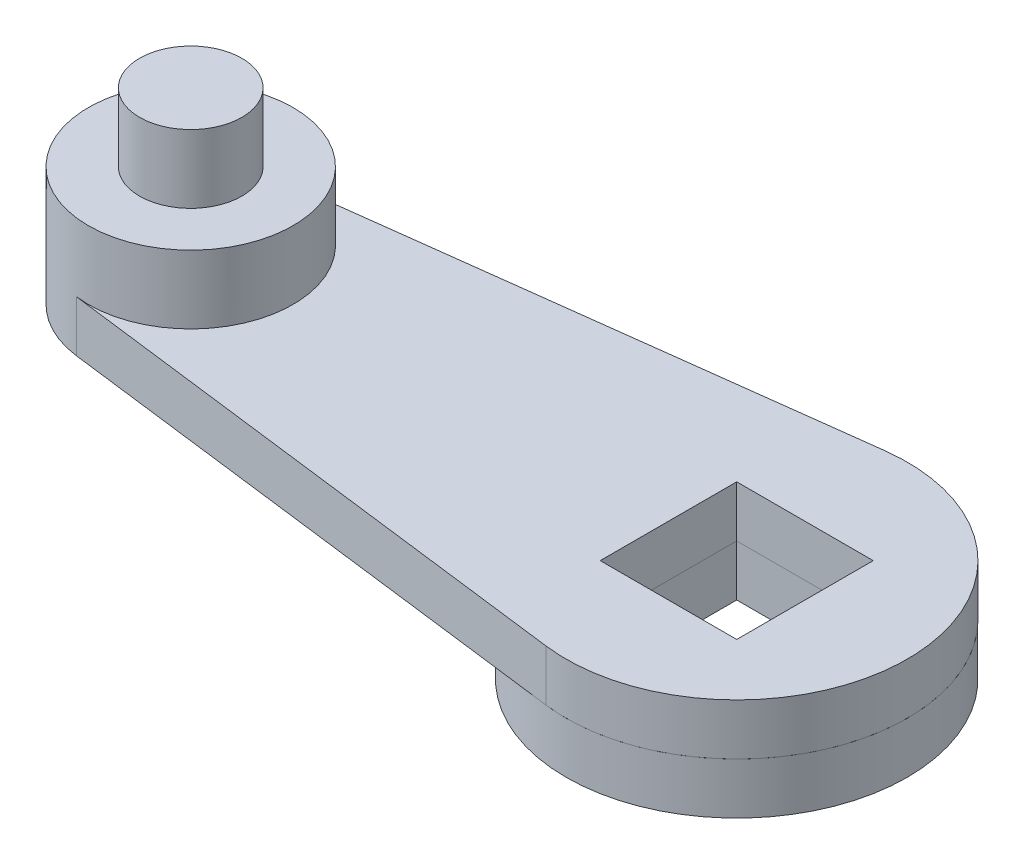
ISO-10303-21;
HEADER;
FILE_DESCRIPTION(('STEP AP214'),'2;1');
FILE_NAME('part.step','',(''),(''),'','','');
FILE_SCHEMA(('AUTOMOTIVE_DESIGN { 1 0 10303 214 1 1 1 1 }'));
ENDSEC;
DATA;
#1=APPLICATION_CONTEXT('core data for automotive mechanical design processes');
#2=APPLICATION_PROTOCOL_DEFINITION('international standard','automotive_design',2000,#1);
#3=PRODUCT_CONTEXT('',#1,'mechanical');
#4=PRODUCT('Part','Part','',(#3));
#5=PRODUCT_RELATED_PRODUCT_CATEGORY('part','',(#4));
#6=PRODUCT_DEFINITION_FORMATION('','',#4);
#7=PRODUCT_DEFINITION_CONTEXT('part definition',#1,'design');
#8=PRODUCT_DEFINITION('design','',#6,#7);
#9=PRODUCT_DEFINITION_SHAPE('','',#8);
#10=(LENGTH_UNIT() NAMED_UNIT(*) SI_UNIT(.MILLI.,.METRE.));
#11=(NAMED_UNIT(*) PLANE_ANGLE_UNIT() SI_UNIT($,.RADIAN.));
#12=(NAMED_UNIT(*) SI_UNIT($,.STERADIAN.) SOLID_ANGLE_UNIT());
#13=UNCERTAINTY_MEASURE_WITH_UNIT(LENGTH_MEASURE(1.E-05),#10,'distance_accuracy_value','');
#14=(GEOMETRIC_REPRESENTATION_CONTEXT(3) GLOBAL_UNCERTAINTY_ASSIGNED_CONTEXT((#13)) GLOBAL_UNIT_ASSIGNED_CONTEXT((#10,
#11,#12)) REPRESENTATION_CONTEXT('',''));
#15=CARTESIAN_POINT('',(0.,0.,0.));
#16=DIRECTION('',(0.,0.,1.));
#17=DIRECTION('',(1.,0.,0.));
#18=AXIS2_PLACEMENT_3D('',#15,#16,#17);
#19=CARTESIAN_POINT('',(-112.37396077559,-15.,-20.));
#20=DIRECTION('',(0.,0.,1.));
#21=DIRECTION('',(1.,0.,0.));
#22=AXIS2_PLACEMENT_3D('',#19,#20,#21);
#23=PLANE('',#22);
#24=DIRECTION('',(1.,0.,0.));
#25=VECTOR('',#24,1.);
#26=CARTESIAN_POINT('',(-112.37396077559,0.,-20.));
#27=LINE('',#26,#25);
#28=CARTESIAN_POINT('',(140.,0.,-20.));
#29=VERTEX_POINT('',#28);
#30=CARTESIAN_POINT('',(180.,0.,-20.));
#31=VERTEX_POINT('',#30);
#32=EDGE_CURVE('E83',#29,#31,#27,.T.);
#33=ORIENTED_EDGE('',*,*,#32,.F.);
#34=DIRECTION('',(0.,1.,0.));
#35=VECTOR('',#34,1.);
#36=CARTESIAN_POINT('',(140.,-15.,-20.));
#37=LINE('',#36,#35);
#38=CARTESIAN_POINT('',(140.,-15.,-20.));
#39=VERTEX_POINT('',#38);
#40=EDGE_CURVE('E12',#39,#29,#37,.T.);
#41=ORIENTED_EDGE('',*,*,#40,.F.);
#42=DIRECTION('',(1.,0.,0.));
#43=VECTOR('',#42,1.);
#44=CARTESIAN_POINT('',(-112.37396077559,-15.,-20.));
#45=LINE('',#44,#43);
#46=CARTESIAN_POINT('',(180.,-15.,-20.));
#47=VERTEX_POINT('',#46);
#48=EDGE_CURVE('E84',#39,#47,#45,.T.);
#49=ORIENTED_EDGE('',*,*,#48,.T.);
#50=DIRECTION('',(0.,1.,0.));
#51=VECTOR('',#50,1.);
#52=CARTESIAN_POINT('',(180.,-15.,-20.));
#53=LINE('',#52,#51);
#54=EDGE_CURVE('E46',#47,#31,#53,.T.);
#55=ORIENTED_EDGE('',*,*,#54,.T.);
#56=EDGE_LOOP('',(#33,#41,#49,#55));
#57=FACE_BOUND('',#56,.T.);
#58=ADVANCED_FACE('F43',(#57),#23,.T.);
#59=CARTESIAN_POINT('',(140.,-15.,0.));
#60=DIRECTION('',(-1.,0.,0.));
#61=DIRECTION('',(0.,0.,1.));
#62=AXIS2_PLACEMENT_3D('',#59,#60,#61);
#63=PLANE('',#62);
#64=DIRECTION('',(0.,0.,1.));
#65=VECTOR('',#64,1.);
#66=CARTESIAN_POINT('',(140.,0.,0.));
#67=LINE('',#66,#65);
#68=CARTESIAN_POINT('',(140.,0.,20.));
#69=VERTEX_POINT('',#68);
#70=EDGE_CURVE('E102',#29,#69,#67,.T.);
#71=ORIENTED_EDGE('',*,*,#70,.T.);
#72=DIRECTION('',(0.,1.,0.));
#73=VECTOR('',#72,1.);
#74=CARTESIAN_POINT('',(140.,-15.,20.));
#75=LINE('',#74,#73);
#76=CARTESIAN_POINT('',(140.,-15.,20.));
#77=VERTEX_POINT('',#76);
#78=EDGE_CURVE('E51',#77,#69,#75,.T.);
#79=ORIENTED_EDGE('',*,*,#78,.F.);
#80=DIRECTION('',(0.,0.,1.));
#81=VECTOR('',#80,1.);
#82=CARTESIAN_POINT('',(140.,-15.,0.));
#83=LINE('',#82,#81);
#84=EDGE_CURVE('E64',#39,#77,#83,.T.);
#85=ORIENTED_EDGE('',*,*,#84,.F.);
#86=ORIENTED_EDGE('',*,*,#40,.T.);
#87=EDGE_LOOP('',(#71,#79,#85,#86));
#88=FACE_BOUND('',#87,.T.);
#89=ADVANCED_FACE('F123',(#88),#63,.F.);
#90=CARTESIAN_POINT('',(-112.37396077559,-15.,20.));
#91=DIRECTION('',(0.,0.,1.));
#92=DIRECTION('',(1.,0.,0.));
#93=AXIS2_PLACEMENT_3D('',#90,#91,#92);
#94=PLANE('',#93);
#95=DIRECTION('',(1.,0.,0.));
#96=VECTOR('',#95,1.);
#97=CARTESIAN_POINT('',(-112.37396077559,0.,20.));
#98=LINE('',#97,#96);
#99=CARTESIAN_POINT('',(180.,0.,20.));
#100=VERTEX_POINT('',#99);
#101=EDGE_CURVE('E97',#69,#100,#98,.T.);
#102=ORIENTED_EDGE('',*,*,#101,.T.);
#103=DIRECTION('',(0.,1.,0.));
#104=VECTOR('',#103,1.);
#105=CARTESIAN_POINT('',(180.,-15.,20.));
#106=LINE('',#105,#104);
#107=CARTESIAN_POINT('',(180.,-15.,20.));
#108=VERTEX_POINT('',#107);
#109=EDGE_CURVE('E88',#108,#100,#106,.T.);
#110=ORIENTED_EDGE('',*,*,#109,.F.);
#111=DIRECTION('',(1.,0.,0.));
#112=VECTOR('',#111,1.);
#113=CARTESIAN_POINT('',(-112.37396077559,-15.,20.));
#114=LINE('',#113,#112);
#115=EDGE_CURVE('E113',#77,#108,#114,.T.);
#116=ORIENTED_EDGE('',*,*,#115,.F.);
#117=ORIENTED_EDGE('',*,*,#78,.T.);
#118=EDGE_LOOP('',(#102,#110,#116,#117));
#119=FACE_BOUND('',#118,.T.);
#120=ADVANCED_FACE('F121',(#119),#94,.F.);
#121=CARTESIAN_POINT('',(180.,-15.,0.));
#122=DIRECTION('',(-1.,0.,0.));
#123=DIRECTION('',(0.,0.,1.));
#124=AXIS2_PLACEMENT_3D('',#121,#122,#123);
#125=PLANE('',#124);
#126=DIRECTION('',(0.,0.,1.));
#127=VECTOR('',#126,1.);
#128=CARTESIAN_POINT('',(180.,0.,0.));
#129=LINE('',#128,#127);
#130=EDGE_CURVE('E91',#31,#100,#129,.T.);
#131=ORIENTED_EDGE('',*,*,#130,.F.);
#132=ORIENTED_EDGE('',*,*,#54,.F.);
#133=DIRECTION('',(0.,0.,1.));
#134=VECTOR('',#133,1.);
#135=CARTESIAN_POINT('',(180.,-15.,0.));
#136=LINE('',#135,#134);
#137=EDGE_CURVE('E111',#47,#108,#136,.T.);
#138=ORIENTED_EDGE('',*,*,#137,.T.);
#139=ORIENTED_EDGE('',*,*,#109,.T.);
#140=EDGE_LOOP('',(#131,#132,#138,#139));
#141=FACE_BOUND('',#140,.T.);
#142=ADVANCED_FACE('F92',(#141),#125,.T.);
#143=CARTESIAN_POINT('',(160.,-15.,0.));
#144=DIRECTION('',(0.,1.,0.));
#145=DIRECTION('',(0.,0.,1.));
#146=AXIS2_PLACEMENT_3D('',#143,#144,#145);
#147=CYLINDRICAL_SURFACE('',#146,50.);
#148=CARTESIAN_POINT('',(160.,-15.,0.));
#149=DIRECTION('',(0.,1.,0.));
#150=DIRECTION('',(0.,0.,1.));
#151=AXIS2_PLACEMENT_3D('',#148,#149,#150);
#152=CIRCLE('',#151,50.);
#153=CARTESIAN_POINT('',(160.,-15.,50.));
#154=VERTEX_POINT('',#153);
#155=EDGE_CURVE('E89',#154,#154,#152,.T.);
#156=ORIENTED_EDGE('',*,*,#155,.T.);
#157=EDGE_LOOP('',(#156));
#158=FACE_BOUND('',#157,.T.);
#159=CARTESIAN_POINT('',(160.,0.,0.));
#160=DIRECTION('',(0.,1.,0.));
#161=DIRECTION('',(0.,0.,1.));
#162=AXIS2_PLACEMENT_3D('',#159,#160,#161);
#163=CIRCLE('',#162,50.);
#164=CARTESIAN_POINT('',(160.,0.,50.));
#165=VERTEX_POINT('',#164);
#166=EDGE_CURVE('E107',#165,#165,#163,.T.);
#167=ORIENTED_EDGE('',*,*,#166,.F.);
#168=EDGE_LOOP('',(#167));
#169=FACE_BOUND('',#168,.T.);
#170=ADVANCED_FACE('F127',(#158,#169),#147,.T.);
#171=CARTESIAN_POINT('',(-112.37396077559,-15.,0.));
#172=DIRECTION('',(0.,1.,0.));
#173=DIRECTION('',(0.,0.,1.));
#174=AXIS2_PLACEMENT_3D('',#171,#172,#173);
#175=PLANE('',#174);
#176=ORIENTED_EDGE('',*,*,#48,.F.);
#177=ORIENTED_EDGE('',*,*,#84,.T.);
#178=ORIENTED_EDGE('',*,*,#115,.T.);
#179=ORIENTED_EDGE('',*,*,#137,.F.);
#180=EDGE_LOOP('',(#176,#177,#178,#179));
#181=FACE_BOUND('',#180,.T.);
#182=ORIENTED_EDGE('',*,*,#155,.F.);
#183=EDGE_LOOP('',(#182));
#184=FACE_BOUND('',#183,.T.);
#185=ADVANCED_FACE('F124',(#181,#184),#175,.F.);
#186=CARTESIAN_POINT('',(-112.37396077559,0.,0.));
#187=DIRECTION('',(0.,1.,0.));
#188=DIRECTION('',(0.,0.,1.));
#189=AXIS2_PLACEMENT_3D('',#186,#187,#188);
#190=PLANE('',#189);
#191=ORIENTED_EDGE('',*,*,#32,.T.);
#192=ORIENTED_EDGE('',*,*,#130,.T.);
#193=ORIENTED_EDGE('',*,*,#101,.F.);
#194=ORIENTED_EDGE('',*,*,#70,.F.);
#195=EDGE_LOOP('',(#191,#192,#193,#194));
#196=FACE_BOUND('',#195,.T.);
#197=ORIENTED_EDGE('',*,*,#166,.T.);
#198=EDGE_LOOP('',(#197));
#199=FACE_BOUND('',#198,.T.);
#200=ADVANCED_FACE('F100',(#196,#199),#190,.T.);
#201=CLOSED_SHELL('',(#58,#89,#120,#142,#170,#185,#200));
#202=MANIFOLD_SOLID_BREP('B2',#201);
#203=CARTESIAN_POINT('',(-112.37396077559,35.,0.));
#204=DIRECTION('',(0.,1.,0.));
#205=DIRECTION('',(0.,0.,1.));
#206=AXIS2_PLACEMENT_3D('',#203,#204,#205);
#207=PLANE('',#206);
#208=CARTESIAN_POINT('',(0.,35.,0.));
#209=DIRECTION('',(0.,1.,0.));
#210=DIRECTION('',(0.,0.,1.));
#211=AXIS2_PLACEMENT_3D('',#208,#209,#210);
#212=CIRCLE('',#211,30.);
#213=CARTESIAN_POINT('',(0.,35.,30.));
#214=VERTEX_POINT('',#213);
#215=EDGE_CURVE('E41',#214,#214,#212,.T.);
#216=ORIENTED_EDGE('',*,*,#215,.T.);
#217=EDGE_LOOP('',(#216));
#218=FACE_BOUND('',#217,.T.);
#219=CARTESIAN_POINT('',(0.,35.,0.));
#220=DIRECTION('',(0.,1.,0.));
#221=DIRECTION('',(0.,0.,1.));
#222=AXIS2_PLACEMENT_3D('',#219,#220,#221);
#223=CIRCLE('',#222,15.);
#224=CARTESIAN_POINT('',(0.,35.,15.));
#225=VERTEX_POINT('',#224);
#226=EDGE_CURVE('E278',#225,#225,#223,.T.);
#227=ORIENTED_EDGE('',*,*,#226,.F.);
#228=EDGE_LOOP('',(#227));
#229=FACE_BOUND('',#228,.T.);
#230=ADVANCED_FACE('F188',(#218,#229),#207,.T.);
#231=CARTESIAN_POINT('',(0.,35.,0.));
#232=DIRECTION('',(0.,-1.,0.));
#233=DIRECTION('',(0.,0.,-1.));
#234=AXIS2_PLACEMENT_3D('',#231,#232,#233);
#235=CYLINDRICAL_SURFACE('',#234,30.);
#236=ORIENTED_EDGE('',*,*,#215,.F.);
#237=EDGE_LOOP('',(#236));
#238=FACE_BOUND('',#237,.T.);
#239=DIRECTION('',(0.,-1.,0.));
#240=VECTOR('',#239,1.);
#241=CARTESIAN_POINT('',(-3.75,15.,29.7647022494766));
#242=LINE('',#241,#240);
#243=CARTESIAN_POINT('',(-3.75,15.,29.7647022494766));
#244=VERTEX_POINT('',#243);
#245=CARTESIAN_POINT('',(-3.75,0.,29.7647022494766));
#246=VERTEX_POINT('',#245);
#247=EDGE_CURVE('E208',#244,#246,#242,.T.);
#248=ORIENTED_EDGE('',*,*,#247,.F.);
#249=CARTESIAN_POINT('',(0.,15.,0.));
#250=DIRECTION('',(0.,1.,0.));
#251=DIRECTION('',(0.,0.,1.));
#252=AXIS2_PLACEMENT_3D('',#249,#250,#251);
#253=CIRCLE('',#252,30.);
#254=CARTESIAN_POINT('',(-3.75,15.,-29.7647022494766));
#255=VERTEX_POINT('',#254);
#256=EDGE_CURVE('E203',#244,#255,#253,.T.);
#257=ORIENTED_EDGE('',*,*,#256,.T.);
#258=DIRECTION('',(0.,-1.,0.));
#259=VECTOR('',#258,1.);
#260=CARTESIAN_POINT('',(-3.75,15.,-29.7647022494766));
#261=LINE('',#260,#259);
#262=CARTESIAN_POINT('',(-3.75,0.,-29.7647022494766));
#263=VERTEX_POINT('',#262);
#264=EDGE_CURVE('E322',#255,#263,#261,.T.);
#265=ORIENTED_EDGE('',*,*,#264,.T.);
#266=CARTESIAN_POINT('',(0.,0.,0.));
#267=DIRECTION('',(0.,1.,0.));
#268=DIRECTION('',(0.,0.,1.));
#269=AXIS2_PLACEMENT_3D('',#266,#267,#268);
#270=CIRCLE('',#269,30.);
#271=EDGE_CURVE('E196',#263,#246,#270,.T.);
#272=ORIENTED_EDGE('',*,*,#271,.T.);
#273=EDGE_LOOP('',(#248,#257,#265,#272));
#274=FACE_BOUND('',#273,.T.);
#275=ADVANCED_FACE('F190',(#238,#274),#235,.T.);
#276=CARTESIAN_POINT('',(-112.37396077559,0.,0.));
#277=DIRECTION('',(0.,1.,0.));
#278=DIRECTION('',(0.,0.,1.));
#279=AXIS2_PLACEMENT_3D('',#276,#277,#278);
#280=PLANE('',#279);
#281=ORIENTED_EDGE('',*,*,#271,.F.);
#282=DIRECTION('',(0.992156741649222,0.,-0.125));
#283=VECTOR('',#282,1.);
#284=CARTESIAN_POINT('',(-114.368117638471,0.,-15.8281294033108));
#285=LINE('',#284,#283);
#286=CARTESIAN_POINT('',(153.75,0.,-49.6078370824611));
#287=VERTEX_POINT('',#286);
#288=EDGE_CURVE('E261',#263,#287,#285,.T.);
#289=ORIENTED_EDGE('',*,*,#288,.T.);
#290=CARTESIAN_POINT('',(160.,0.,0.));
#291=DIRECTION('',(0.,1.,0.));
#292=DIRECTION('',(0.,0.,1.));
#293=AXIS2_PLACEMENT_3D('',#290,#291,#292);
#294=CIRCLE('',#293,50.);
#295=CARTESIAN_POINT('',(153.75,0.,49.6078370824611));
#296=VERTEX_POINT('',#295);
#297=EDGE_CURVE('E254',#296,#287,#294,.T.);
#298=ORIENTED_EDGE('',*,*,#297,.F.);
#299=DIRECTION('',(0.992156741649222,0.,0.125));
#300=VECTOR('',#299,1.);
#301=CARTESIAN_POINT('',(-114.368117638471,0.,15.8281294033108));
#302=LINE('',#301,#300);
#303=EDGE_CURVE('E259',#246,#296,#302,.T.);
#304=ORIENTED_EDGE('',*,*,#303,.F.);
#305=EDGE_LOOP('',(#281,#289,#298,#304));
#306=FACE_BOUND('',#305,.T.);
#307=DIRECTION('',(1.,0.,0.));
#308=VECTOR('',#307,1.);
#309=CARTESIAN_POINT('',(-112.37396077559,0.,-20.));
#310=LINE('',#309,#308);
#311=CARTESIAN_POINT('',(140.,0.,-20.));
#312=VERTEX_POINT('',#311);
#313=CARTESIAN_POINT('',(180.,0.,-20.));
#314=VERTEX_POINT('',#313);
#315=EDGE_CURVE('E283',#312,#314,#310,.T.);
#316=ORIENTED_EDGE('',*,*,#315,.F.);
#317=DIRECTION('',(0.,0.,1.));
#318=VECTOR('',#317,1.);
#319=CARTESIAN_POINT('',(140.,0.,0.));
#320=LINE('',#319,#318);
#321=CARTESIAN_POINT('',(140.,0.,20.));
#322=VERTEX_POINT('',#321);
#323=EDGE_CURVE('E292',#312,#322,#320,.T.);
#324=ORIENTED_EDGE('',*,*,#323,.T.);
#325=DIRECTION('',(1.,0.,0.));
#326=VECTOR('',#325,1.);
#327=CARTESIAN_POINT('',(-112.37396077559,0.,20.));
#328=LINE('',#327,#326);
#329=CARTESIAN_POINT('',(180.,0.,20.));
#330=VERTEX_POINT('',#329);
#331=EDGE_CURVE('E289',#322,#330,#328,.T.);
#332=ORIENTED_EDGE('',*,*,#331,.T.);
#333=DIRECTION('',(0.,0.,1.));
#334=VECTOR('',#333,1.);
#335=CARTESIAN_POINT('',(180.,0.,0.));
#336=LINE('',#335,#334);
#337=EDGE_CURVE('E286',#314,#330,#336,.T.);
#338=ORIENTED_EDGE('',*,*,#337,.F.);
#339=EDGE_LOOP('',(#316,#324,#332,#338));
#340=FACE_BOUND('',#339,.T.);
#341=ADVANCED_FACE('F256',(#306,#340),#280,.F.);
#342=CARTESIAN_POINT('',(-112.37396077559,15.,-20.));
#343=DIRECTION('',(0.,0.,-1.));
#344=DIRECTION('',(-1.,0.,0.));
#345=AXIS2_PLACEMENT_3D('',#342,#343,#344);
#346=PLANE('',#345);
#347=ORIENTED_EDGE('',*,*,#315,.T.);
#348=DIRECTION('',(0.,-1.,0.));
#349=VECTOR('',#348,1.);
#350=CARTESIAN_POINT('',(180.,15.,-20.));
#351=LINE('',#350,#349);
#352=CARTESIAN_POINT('',(180.,15.,-20.));
#353=VERTEX_POINT('',#352);
#354=EDGE_CURVE('E318',#353,#314,#351,.T.);
#355=ORIENTED_EDGE('',*,*,#354,.F.);
#356=DIRECTION('',(1.,0.,0.));
#357=VECTOR('',#356,1.);
#358=CARTESIAN_POINT('',(-112.37396077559,15.,-20.));
#359=LINE('',#358,#357);
#360=CARTESIAN_POINT('',(140.,15.,-20.));
#361=VERTEX_POINT('',#360);
#362=EDGE_CURVE('E302',#361,#353,#359,.T.);
#363=ORIENTED_EDGE('',*,*,#362,.F.);
#364=DIRECTION('',(0.,-1.,0.));
#365=VECTOR('',#364,1.);
#366=CARTESIAN_POINT('',(140.,15.,-20.));
#367=LINE('',#366,#365);
#368=EDGE_CURVE('E271',#361,#312,#367,.T.);
#369=ORIENTED_EDGE('',*,*,#368,.T.);
#370=EDGE_LOOP('',(#347,#355,#363,#369));
#371=FACE_BOUND('',#370,.T.);
#372=ADVANCED_FACE('F340',(#371),#346,.F.);
#373=CARTESIAN_POINT('',(180.,15.,0.));
#374=DIRECTION('',(1.,0.,0.));
#375=DIRECTION('',(0.,0.,-1.));
#376=AXIS2_PLACEMENT_3D('',#373,#374,#375);
#377=PLANE('',#376);
#378=ORIENTED_EDGE('',*,*,#337,.T.);
#379=DIRECTION('',(0.,-1.,0.));
#380=VECTOR('',#379,1.);
#381=CARTESIAN_POINT('',(180.,15.,20.));
#382=LINE('',#381,#380);
#383=CARTESIAN_POINT('',(180.,15.,20.));
#384=VERTEX_POINT('',#383);
#385=EDGE_CURVE('E316',#384,#330,#382,.T.);
#386=ORIENTED_EDGE('',*,*,#385,.F.);
#387=DIRECTION('',(0.,0.,1.));
#388=VECTOR('',#387,1.);
#389=CARTESIAN_POINT('',(180.,15.,0.));
#390=LINE('',#389,#388);
#391=EDGE_CURVE('E305',#353,#384,#390,.T.);
#392=ORIENTED_EDGE('',*,*,#391,.F.);
#393=ORIENTED_EDGE('',*,*,#354,.T.);
#394=EDGE_LOOP('',(#378,#386,#392,#393));
#395=FACE_BOUND('',#394,.T.);
#396=ADVANCED_FACE('F343',(#395),#377,.F.);
#397=CARTESIAN_POINT('',(-112.37396077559,15.,20.));
#398=DIRECTION('',(0.,0.,-1.));
#399=DIRECTION('',(-1.,0.,0.));
#400=AXIS2_PLACEMENT_3D('',#397,#398,#399);
#401=PLANE('',#400);
#402=ORIENTED_EDGE('',*,*,#331,.F.);
#403=DIRECTION('',(0.,-1.,0.));
#404=VECTOR('',#403,1.);
#405=CARTESIAN_POINT('',(140.,15.,20.));
#406=LINE('',#405,#404);
#407=CARTESIAN_POINT('',(140.,15.,20.));
#408=VERTEX_POINT('',#407);
#409=EDGE_CURVE('E314',#408,#322,#406,.T.);
#410=ORIENTED_EDGE('',*,*,#409,.F.);
#411=DIRECTION('',(1.,0.,0.));
#412=VECTOR('',#411,1.);
#413=CARTESIAN_POINT('',(-112.37396077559,15.,20.));
#414=LINE('',#413,#412);
#415=EDGE_CURVE('E307',#408,#384,#414,.T.);
#416=ORIENTED_EDGE('',*,*,#415,.T.);
#417=ORIENTED_EDGE('',*,*,#385,.T.);
#418=EDGE_LOOP('',(#402,#410,#416,#417));
#419=FACE_BOUND('',#418,.T.);
#420=ADVANCED_FACE('F346',(#419),#401,.T.);
#421=CARTESIAN_POINT('',(-114.368117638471,15.,15.8281294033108));
#422=DIRECTION('',(0.125,0.,-0.992156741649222));
#423=DIRECTION('',(-0.992156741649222,0.,-0.125));
#424=AXIS2_PLACEMENT_3D('',#421,#422,#423);
#425=PLANE('',#424);
#426=ORIENTED_EDGE('',*,*,#303,.T.);
#427=DIRECTION('',(0.,-1.,0.));
#428=VECTOR('',#427,1.);
#429=CARTESIAN_POINT('',(153.75,15.,49.6078370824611));
#430=LINE('',#429,#428);
#431=CARTESIAN_POINT('',(153.75,15.,49.6078370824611));
#432=VERTEX_POINT('',#431);
#433=EDGE_CURVE('E266',#432,#296,#430,.T.);
#434=ORIENTED_EDGE('',*,*,#433,.F.);
#435=DIRECTION('',(0.992156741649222,0.,0.125));
#436=VECTOR('',#435,1.);
#437=CARTESIAN_POINT('',(-114.368117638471,15.,15.8281294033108));
#438=LINE('',#437,#436);
#439=EDGE_CURVE('E295',#244,#432,#438,.T.);
#440=ORIENTED_EDGE('',*,*,#439,.F.);
#441=ORIENTED_EDGE('',*,*,#247,.T.);
#442=EDGE_LOOP('',(#426,#434,#440,#441));
#443=FACE_BOUND('',#442,.T.);
#444=ADVANCED_FACE('F274',(#443),#425,.F.);
#445=CARTESIAN_POINT('',(160.,15.,0.));
#446=DIRECTION('',(0.,-1.,0.));
#447=DIRECTION('',(0.,0.,-1.));
#448=AXIS2_PLACEMENT_3D('',#445,#446,#447);
#449=CYLINDRICAL_SURFACE('',#448,50.);
#450=ORIENTED_EDGE('',*,*,#297,.T.);
#451=DIRECTION('',(0.,-1.,0.));
#452=VECTOR('',#451,1.);
#453=CARTESIAN_POINT('',(153.75,15.,-49.6078370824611));
#454=LINE('',#453,#452);
#455=CARTESIAN_POINT('',(153.75,15.,-49.6078370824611));
#456=VERTEX_POINT('',#455);
#457=EDGE_CURVE('E272',#456,#287,#454,.T.);
#458=ORIENTED_EDGE('',*,*,#457,.F.);
#459=CARTESIAN_POINT('',(160.,15.,0.));
#460=DIRECTION('',(0.,1.,0.));
#461=DIRECTION('',(0.,0.,1.));
#462=AXIS2_PLACEMENT_3D('',#459,#460,#461);
#463=CIRCLE('',#462,50.);
#464=EDGE_CURVE('E268',#432,#456,#463,.T.);
#465=ORIENTED_EDGE('',*,*,#464,.F.);
#466=ORIENTED_EDGE('',*,*,#433,.T.);
#467=EDGE_LOOP('',(#450,#458,#465,#466));
#468=FACE_BOUND('',#467,.T.);
#469=ADVANCED_FACE('F267',(#468),#449,.T.);
#470=CARTESIAN_POINT('',(-114.368117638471,15.,-15.8281294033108));
#471=DIRECTION('',(-0.125,0.,-0.992156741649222));
#472=DIRECTION('',(-0.992156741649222,0.,0.125));
#473=AXIS2_PLACEMENT_3D('',#470,#471,#472);
#474=PLANE('',#473);
#475=ORIENTED_EDGE('',*,*,#288,.F.);
#476=ORIENTED_EDGE('',*,*,#264,.F.);
#477=DIRECTION('',(0.992156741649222,0.,-0.125));
#478=VECTOR('',#477,1.);
#479=CARTESIAN_POINT('',(-114.368117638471,15.,-15.8281294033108));
#480=LINE('',#479,#478);
#481=EDGE_CURVE('E298',#255,#456,#480,.T.);
#482=ORIENTED_EDGE('',*,*,#481,.T.);
#483=ORIENTED_EDGE('',*,*,#457,.T.);
#484=EDGE_LOOP('',(#475,#476,#482,#483));
#485=FACE_BOUND('',#484,.T.);
#486=ADVANCED_FACE('F326',(#485),#474,.T.);
#487=CARTESIAN_POINT('',(140.,15.,0.));
#488=DIRECTION('',(1.,0.,0.));
#489=DIRECTION('',(0.,0.,-1.));
#490=AXIS2_PLACEMENT_3D('',#487,#488,#489);
#491=PLANE('',#490);
#492=ORIENTED_EDGE('',*,*,#323,.F.);
#493=ORIENTED_EDGE('',*,*,#368,.F.);
#494=DIRECTION('',(0.,0.,1.));
#495=VECTOR('',#494,1.);
#496=CARTESIAN_POINT('',(140.,15.,0.));
#497=LINE('',#496,#495);
#498=EDGE_CURVE('E310',#361,#408,#497,.T.);
#499=ORIENTED_EDGE('',*,*,#498,.T.);
#500=ORIENTED_EDGE('',*,*,#409,.T.);
#501=EDGE_LOOP('',(#492,#493,#499,#500));
#502=FACE_BOUND('',#501,.T.);
#503=ADVANCED_FACE('F332',(#502),#491,.T.);
#504=CARTESIAN_POINT('',(-112.37396077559,15.,0.));
#505=DIRECTION('',(0.,1.,0.));
#506=DIRECTION('',(0.,0.,1.));
#507=AXIS2_PLACEMENT_3D('',#504,#505,#506);
#508=PLANE('',#507);
#509=ORIENTED_EDGE('',*,*,#439,.T.);
#510=ORIENTED_EDGE('',*,*,#464,.T.);
#511=ORIENTED_EDGE('',*,*,#481,.F.);
#512=ORIENTED_EDGE('',*,*,#256,.F.);
#513=EDGE_LOOP('',(#509,#510,#511,#512));
#514=FACE_BOUND('',#513,.T.);
#515=ORIENTED_EDGE('',*,*,#362,.T.);
#516=ORIENTED_EDGE('',*,*,#391,.T.);
#517=ORIENTED_EDGE('',*,*,#415,.F.);
#518=ORIENTED_EDGE('',*,*,#498,.F.);
#519=EDGE_LOOP('',(#515,#516,#517,#518));
#520=FACE_BOUND('',#519,.T.);
#521=ADVANCED_FACE('F328',(#514,#520),#508,.T.);
#522=CARTESIAN_POINT('',(0.,55.,0.));
#523=DIRECTION('',(0.,-1.,0.));
#524=DIRECTION('',(0.,0.,-1.));
#525=AXIS2_PLACEMENT_3D('',#522,#523,#524);
#526=CYLINDRICAL_SURFACE('',#525,15.);
#527=CARTESIAN_POINT('',(0.,55.,0.));
#528=DIRECTION('',(0.,1.,0.));
#529=DIRECTION('',(0.,0.,1.));
#530=AXIS2_PLACEMENT_3D('',#527,#528,#529);
#531=CIRCLE('',#530,15.);
#532=CARTESIAN_POINT('',(0.,55.,15.));
#533=VERTEX_POINT('',#532);
#534=EDGE_CURVE('E275',#533,#533,#531,.T.);
#535=ORIENTED_EDGE('',*,*,#534,.F.);
#536=EDGE_LOOP('',(#535));
#537=FACE_BOUND('',#536,.T.);
#538=ORIENTED_EDGE('',*,*,#226,.T.);
#539=EDGE_LOOP('',(#538));
#540=FACE_BOUND('',#539,.T.);
#541=ADVANCED_FACE('F331',(#537,#540),#526,.T.);
#542=CARTESIAN_POINT('',(0.,55.,0.));
#543=DIRECTION('',(0.,1.,0.));
#544=DIRECTION('',(0.,0.,1.));
#545=AXIS2_PLACEMENT_3D('',#542,#543,#544);
#546=PLANE('',#545);
#547=ORIENTED_EDGE('',*,*,#534,.T.);
#548=EDGE_LOOP('',(#547));
#549=FACE_BOUND('',#548,.T.);
#550=ADVANCED_FACE('F368',(#549),#546,.T.);
#551=CLOSED_SHELL('',(#230,#275,#341,#372,#396,#420,#444,#469,#486,#503,#521,#541,#550));
#552=MANIFOLD_SOLID_BREP('B6',#551);
#553=ADVANCED_BREP_SHAPE_REPRESENTATION('',(#18,#202,#552),#14);
#554=SHAPE_DEFINITION_REPRESENTATION(#9,#553);
ENDSEC;
END-ISO-10303-21;
